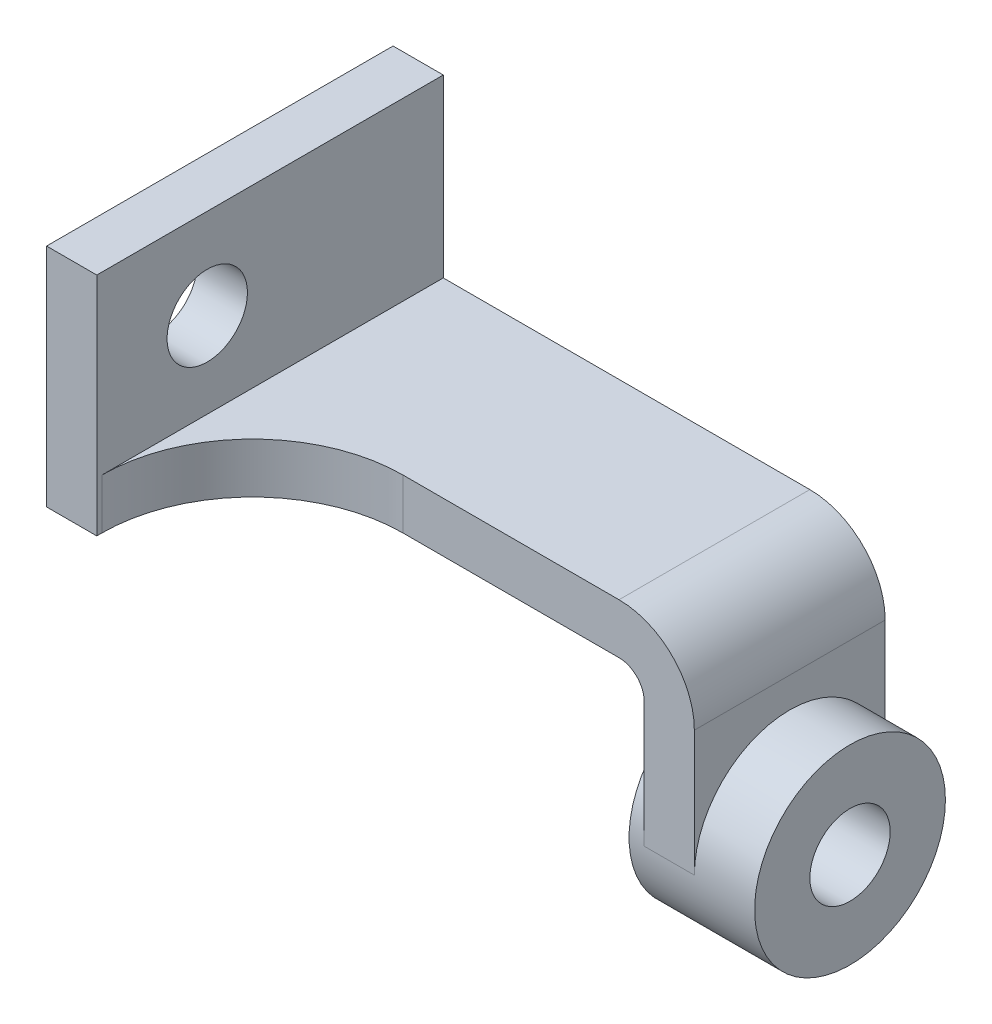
from build123d import *

# Parameters (mm, degrees)
SKETCH1_W                = 69
SKETCH1_H                = 45
BASE_EXTRUDE_DEPTH       = 10
BOSS_EXTRUDE1_DEPTH      = 19
FILLET1_R                = 30
BOSS_EXTRUDE2_DEPTH      = 12
BOSS_EXTRUDE2_DEPTH_BACK = 13
SKETCH3_R                = 19
SKETCH4_R                = 8
CUT_EXTRUDE1_DEPTH       = 141.400320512
SKETCH5_R                = 8
CUT_EXTRUDE2_DEPTH       = 133.711152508
FILLET4_R                = 15
FILLET5_R                = 5


with BuildPart() as part:
    # Sketch1 → Base-Extrude (new body)
    with BuildSketch(Plane(origin=(0, 0, 0), x_dir=(0, 0, -1), z_dir=(1, 0, 0))):
        with Locations((-15.5, 0)):
            Rectangle(SKETCH1_W, SKETCH1_H)
    extrude(amount=BASE_EXTRUDE_DEPTH)

    # Sketch2 → Boss-Extrude1 (add, symmetric)
    with BuildSketch(Plane.XY):
        Polygon((10, -12.5), (10, -22.5), (88, -22.5), (88, -52.5), (98, -52.5), (98, -12.5), align=None)
    extrude(amount=BOSS_EXTRUDE1_DEPTH, both=True)

    # Fillet1
    fillet1_edges = [part.edges().sort_by_distance(p)[0] for p in [
        (10, -17.5, 19),
    ]]
    fillet(fillet1_edges, radius=FILLET1_R)

    # Sketch3 → Boss-Extrude2 (add, two sides: drawn at the far end of the back side and taken through both)
    with BuildSketch(Plane(origin=(98, 0, 0), x_dir=(0, 0, -1), z_dir=(1, 0, 0)).offset(-BOSS_EXTRUDE2_DEPTH_BACK)):
        with Locations((0, -52.5)):
            Circle(SKETCH3_R)
    extrude(amount=BOSS_EXTRUDE2_DEPTH + BOSS_EXTRUDE2_DEPTH_BACK)

    # Sketch4 → Cut-Extrude1 (cut, through all)
    with BuildSketch(Plane(origin=(110, 0, 0), x_dir=(0, 0, -1), z_dir=(1, 0, 0))):
        with Locations((0, -52.5)):
            Circle(SKETCH4_R)
    extrude(amount=-CUT_EXTRUDE1_DEPTH, mode=Mode.SUBTRACT)

    # Sketch5 → Cut-Extrude2 (cut, through all)
    with BuildSketch(Plane(origin=(10, 0, 0), x_dir=(0, 0, -1), z_dir=(1, 0, 0))):
        with Locations((-28, 4.5)):
            Circle(SKETCH5_R)
    extrude(amount=-CUT_EXTRUDE2_DEPTH, mode=Mode.SUBTRACT)

    # Fillet4
    fillet4_edges = [part.edges().sort_by_distance(p)[0] for p in [
        (98, -12.5, 0),
    ]]
    fillet(fillet4_edges, radius=FILLET4_R)

    # Fillet5
    fillet5_edges = [part.edges().sort_by_distance(p)[0] for p in [
        (88, -22.5, 0),
    ]]
    fillet(fillet5_edges, radius=FILLET5_R)


solid = part.part
